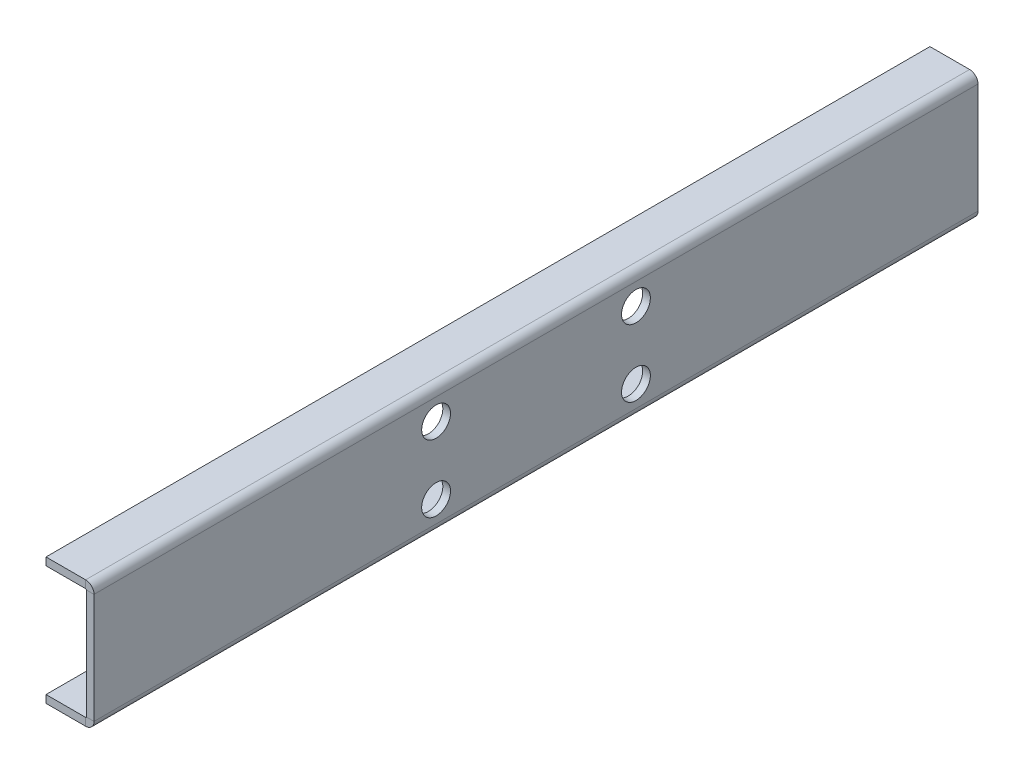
ISO-10303-21;
HEADER;
FILE_DESCRIPTION(('STEP AP214'),'2;1');
FILE_NAME('part.step','',(''),(''),'','','');
FILE_SCHEMA(('AUTOMOTIVE_DESIGN { 1 0 10303 214 1 1 1 1 }'));
ENDSEC;
DATA;
#1=APPLICATION_CONTEXT('core data for automotive mechanical design processes');
#2=APPLICATION_PROTOCOL_DEFINITION('international standard','automotive_design',2000,#1);
#3=PRODUCT_CONTEXT('',#1,'mechanical');
#4=PRODUCT('Part','Part','',(#3));
#5=PRODUCT_RELATED_PRODUCT_CATEGORY('part','',(#4));
#6=PRODUCT_DEFINITION_FORMATION('','',#4);
#7=PRODUCT_DEFINITION_CONTEXT('part definition',#1,'design');
#8=PRODUCT_DEFINITION('design','',#6,#7);
#9=PRODUCT_DEFINITION_SHAPE('','',#8);
#10=(LENGTH_UNIT() NAMED_UNIT(*) SI_UNIT(.MILLI.,.METRE.));
#11=(NAMED_UNIT(*) PLANE_ANGLE_UNIT() SI_UNIT($,.RADIAN.));
#12=(NAMED_UNIT(*) SI_UNIT($,.STERADIAN.) SOLID_ANGLE_UNIT());
#13=UNCERTAINTY_MEASURE_WITH_UNIT(LENGTH_MEASURE(1.E-05),#10,'distance_accuracy_value','');
#14=(GEOMETRIC_REPRESENTATION_CONTEXT(3) GLOBAL_UNCERTAINTY_ASSIGNED_CONTEXT((#13)) GLOBAL_UNIT_ASSIGNED_CONTEXT((#10,
#11,#12)) REPRESENTATION_CONTEXT('',''));
#15=CARTESIAN_POINT('',(0.,0.,0.));
#16=DIRECTION('',(0.,0.,1.));
#17=DIRECTION('',(1.,0.,0.));
#18=AXIS2_PLACEMENT_3D('',#15,#16,#17);
#19=CARTESIAN_POINT('',(-0.736600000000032,0.,460.));
#20=DIRECTION('',(0.,0.,1.));
#21=DIRECTION('',(1.,0.,0.));
#22=AXIS2_PLACEMENT_3D('',#19,#20,#21);
#23=PLANE('',#22);
#24=DIRECTION('',(0.,1.,0.));
#25=VECTOR('',#24,1.);
#26=CARTESIAN_POINT('',(-0.736600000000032,0.,460.));
#27=LINE('',#26,#25);
#28=CARTESIAN_POINT('',(-0.736600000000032,0.,460.));
#29=VERTEX_POINT('',#28);
#30=CARTESIAN_POINT('',(-0.736600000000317,8.,460.));
#31=VERTEX_POINT('',#30);
#32=EDGE_CURVE('E11',#29,#31,#27,.T.);
#33=ORIENTED_EDGE('',*,*,#32,.F.);
#34=CARTESIAN_POINT('',(-0.736600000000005,-0.7366,460.));
#35=DIRECTION('',(0.,0.,1.));
#36=DIRECTION('',(1.,0.,0.));
#37=AXIS2_PLACEMENT_3D('',#34,#35,#36);
#38=CIRCLE('',#37,0.7366);
#39=CARTESIAN_POINT('',(0.,-0.736599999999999,460.));
#40=VERTEX_POINT('',#39);
#41=EDGE_CURVE('E213',#29,#40,#38,.F.);
#42=ORIENTED_EDGE('',*,*,#41,.T.);
#43=DIRECTION('',(-1.,0.,0.));
#44=VECTOR('',#43,1.);
#45=CARTESIAN_POINT('',(8.,-0.736599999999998,460.));
#46=LINE('',#45,#44);
#47=CARTESIAN_POINT('',(8.,-0.736599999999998,460.));
#48=VERTEX_POINT('',#47);
#49=EDGE_CURVE('E51',#48,#40,#46,.T.);
#50=ORIENTED_EDGE('',*,*,#49,.F.);
#51=CARTESIAN_POINT('',(-0.736600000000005,-0.7366,460.));
#52=DIRECTION('',(0.,0.,1.));
#53=DIRECTION('',(1.,0.,0.));
#54=AXIS2_PLACEMENT_3D('',#51,#52,#53);
#55=CIRCLE('',#54,8.7366);
#56=EDGE_CURVE('E201',#31,#48,#55,.F.);
#57=ORIENTED_EDGE('',*,*,#56,.F.);
#58=EDGE_LOOP('',(#33,#42,#50,#57));
#59=FACE_BOUND('',#58,.T.);
#60=ADVANCED_FACE('F43',(#59),#23,.T.);
#61=CARTESIAN_POINT('',(8.,-0.736599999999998,460.));
#62=DIRECTION('',(0.,0.,1.));
#63=DIRECTION('',(1.,0.,0.));
#64=AXIS2_PLACEMENT_3D('',#61,#62,#63);
#65=PLANE('',#64);
#66=DIRECTION('',(1.,0.,0.));
#67=VECTOR('',#66,1.);
#68=CARTESIAN_POINT('',(-42.,0.,460.));
#69=LINE('',#68,#67);
#70=CARTESIAN_POINT('',(-42.,0.,460.));
#71=VERTEX_POINT('',#70);
#72=EDGE_CURVE('E210',#71,#29,#69,.T.);
#73=ORIENTED_EDGE('',*,*,#72,.T.);
#74=ORIENTED_EDGE('',*,*,#32,.T.);
#75=DIRECTION('',(1.,0.,0.));
#76=VECTOR('',#75,1.);
#77=CARTESIAN_POINT('',(-42.,8.,460.));
#78=LINE('',#77,#76);
#79=CARTESIAN_POINT('',(-42.,8.,460.));
#80=VERTEX_POINT('',#79);
#81=EDGE_CURVE('E204',#80,#31,#78,.T.);
#82=ORIENTED_EDGE('',*,*,#81,.F.);
#83=DIRECTION('',(0.,1.,0.));
#84=VECTOR('',#83,1.);
#85=CARTESIAN_POINT('',(-42.,0.,460.));
#86=LINE('',#85,#84);
#87=EDGE_CURVE('E207',#71,#80,#86,.T.);
#88=ORIENTED_EDGE('',*,*,#87,.F.);
#89=EDGE_LOOP('',(#73,#74,#82,#88));
#90=FACE_BOUND('',#89,.T.);
#91=ADVANCED_FACE('F313',(#90),#65,.T.);
#92=CARTESIAN_POINT('',(0.,-0.736599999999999,-460.));
#93=DIRECTION('',(0.,0.,-1.));
#94=DIRECTION('',(-1.,0.,0.));
#95=AXIS2_PLACEMENT_3D('',#92,#93,#94);
#96=PLANE('',#95);
#97=DIRECTION('',(1.,0.,0.));
#98=VECTOR('',#97,1.);
#99=CARTESIAN_POINT('',(0.,-0.736599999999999,-460.));
#100=LINE('',#99,#98);
#101=CARTESIAN_POINT('',(0.,-0.736599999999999,-460.));
#102=VERTEX_POINT('',#101);
#103=CARTESIAN_POINT('',(8.,-0.736599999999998,-460.));
#104=VERTEX_POINT('',#103);
#105=EDGE_CURVE('E254',#102,#104,#100,.T.);
#106=ORIENTED_EDGE('',*,*,#105,.F.);
#107=CARTESIAN_POINT('',(-0.736600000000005,-0.7366,-460.));
#108=DIRECTION('',(0.,0.,1.));
#109=DIRECTION('',(1.,0.,0.));
#110=AXIS2_PLACEMENT_3D('',#107,#108,#109);
#111=CIRCLE('',#110,0.7366);
#112=CARTESIAN_POINT('',(-0.736600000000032,0.,-460.));
#113=VERTEX_POINT('',#112);
#114=EDGE_CURVE('E180',#113,#102,#111,.F.);
#115=ORIENTED_EDGE('',*,*,#114,.F.);
#116=DIRECTION('',(0.,-1.,0.));
#117=VECTOR('',#116,1.);
#118=CARTESIAN_POINT('',(-0.736600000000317,8.,-460.));
#119=LINE('',#118,#117);
#120=CARTESIAN_POINT('',(-0.736600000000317,8.,-460.));
#121=VERTEX_POINT('',#120);
#122=EDGE_CURVE('E252',#121,#113,#119,.T.);
#123=ORIENTED_EDGE('',*,*,#122,.F.);
#124=CARTESIAN_POINT('',(-0.736600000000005,-0.7366,-460.));
#125=DIRECTION('',(0.,0.,1.));
#126=DIRECTION('',(1.,0.,0.));
#127=AXIS2_PLACEMENT_3D('',#124,#125,#126);
#128=CIRCLE('',#127,8.7366);
#129=EDGE_CURVE('E168',#121,#104,#128,.F.);
#130=ORIENTED_EDGE('',*,*,#129,.T.);
#131=EDGE_LOOP('',(#106,#115,#123,#130));
#132=FACE_BOUND('',#131,.T.);
#133=ADVANCED_FACE('F298',(#132),#96,.T.);
#134=CARTESIAN_POINT('',(-0.736600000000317,8.,-460.));
#135=DIRECTION('',(0.,0.,-1.));
#136=DIRECTION('',(-1.,0.,0.));
#137=AXIS2_PLACEMENT_3D('',#134,#135,#136);
#138=PLANE('',#137);
#139=DIRECTION('',(0.,-1.,0.));
#140=VECTOR('',#139,1.);
#141=CARTESIAN_POINT('',(0.,0.,-460.));
#142=LINE('',#141,#140);
#143=CARTESIAN_POINT('',(0.,-115.2634,-460.));
#144=VERTEX_POINT('',#143);
#145=EDGE_CURVE('E183',#102,#144,#142,.T.);
#146=ORIENTED_EDGE('',*,*,#145,.F.);
#147=ORIENTED_EDGE('',*,*,#105,.T.);
#148=DIRECTION('',(0.,-1.,0.));
#149=VECTOR('',#148,1.);
#150=CARTESIAN_POINT('',(8.,0.,-460.));
#151=LINE('',#150,#149);
#152=CARTESIAN_POINT('',(8.00000000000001,-115.263399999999,-460.));
#153=VERTEX_POINT('',#152);
#154=EDGE_CURVE('E165',#104,#153,#151,.T.);
#155=ORIENTED_EDGE('',*,*,#154,.T.);
#156=DIRECTION('',(-1.,0.,0.));
#157=VECTOR('',#156,1.);
#158=CARTESIAN_POINT('',(8.00000000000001,-115.263399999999,-460.));
#159=LINE('',#158,#157);
#160=EDGE_CURVE('E143',#153,#144,#159,.T.);
#161=ORIENTED_EDGE('',*,*,#160,.T.);
#162=EDGE_LOOP('',(#146,#147,#155,#161));
#163=FACE_BOUND('',#162,.T.);
#164=ADVANCED_FACE('F354',(#163),#138,.T.);
#165=CARTESIAN_POINT('',(0.,-115.2634,460.));
#166=DIRECTION('',(0.,0.,1.));
#167=DIRECTION('',(1.,0.,0.));
#168=AXIS2_PLACEMENT_3D('',#165,#166,#167);
#169=PLANE('',#168);
#170=DIRECTION('',(1.,0.,0.));
#171=VECTOR('',#170,1.);
#172=CARTESIAN_POINT('',(0.,-115.2634,460.));
#173=LINE('',#172,#171);
#174=CARTESIAN_POINT('',(0.,-115.2634,460.));
#175=VERTEX_POINT('',#174);
#176=CARTESIAN_POINT('',(8.00000000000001,-115.263399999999,460.));
#177=VERTEX_POINT('',#176);
#178=EDGE_CURVE('E66',#175,#177,#173,.T.);
#179=ORIENTED_EDGE('',*,*,#178,.F.);
#180=CARTESIAN_POINT('',(-0.736599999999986,-115.2634,460.));
#181=DIRECTION('',(0.,0.,1.));
#182=DIRECTION('',(1.,0.,0.));
#183=AXIS2_PLACEMENT_3D('',#180,#181,#182);
#184=CIRCLE('',#183,0.7366);
#185=CARTESIAN_POINT('',(-0.736599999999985,-116.,460.));
#186=VERTEX_POINT('',#185);
#187=EDGE_CURVE('E218',#175,#186,#184,.F.);
#188=ORIENTED_EDGE('',*,*,#187,.T.);
#189=DIRECTION('',(0.,1.,0.));
#190=VECTOR('',#189,1.);
#191=CARTESIAN_POINT('',(-0.736599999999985,-124.,460.));
#192=LINE('',#191,#190);
#193=CARTESIAN_POINT('',(-0.736599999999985,-124.,460.));
#194=VERTEX_POINT('',#193);
#195=EDGE_CURVE('E59',#194,#186,#192,.T.);
#196=ORIENTED_EDGE('',*,*,#195,.F.);
#197=CARTESIAN_POINT('',(-0.736599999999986,-115.2634,460.));
#198=DIRECTION('',(0.,0.,1.));
#199=DIRECTION('',(1.,0.,0.));
#200=AXIS2_PLACEMENT_3D('',#197,#198,#199);
#201=CIRCLE('',#200,8.7366);
#202=EDGE_CURVE('E195',#177,#194,#201,.F.);
#203=ORIENTED_EDGE('',*,*,#202,.F.);
#204=EDGE_LOOP('',(#179,#188,#196,#203));
#205=FACE_BOUND('',#204,.T.);
#206=ADVANCED_FACE('F330',(#205),#169,.T.);
#207=CARTESIAN_POINT('',(-0.736599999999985,-124.,460.));
#208=DIRECTION('',(0.,0.,1.));
#209=DIRECTION('',(1.,0.,0.));
#210=AXIS2_PLACEMENT_3D('',#207,#208,#209);
#211=PLANE('',#210);
#212=DIRECTION('',(0.,-1.,0.));
#213=VECTOR('',#212,1.);
#214=CARTESIAN_POINT('',(0.,0.,460.));
#215=LINE('',#214,#213);
#216=EDGE_CURVE('E216',#40,#175,#215,.T.);
#217=ORIENTED_EDGE('',*,*,#216,.T.);
#218=ORIENTED_EDGE('',*,*,#178,.T.);
#219=DIRECTION('',(0.,-1.,0.));
#220=VECTOR('',#219,1.);
#221=CARTESIAN_POINT('',(8.,0.,460.));
#222=LINE('',#221,#220);
#223=EDGE_CURVE('E198',#48,#177,#222,.T.);
#224=ORIENTED_EDGE('',*,*,#223,.F.);
#225=ORIENTED_EDGE('',*,*,#49,.T.);
#226=EDGE_LOOP('',(#217,#218,#224,#225));
#227=FACE_BOUND('',#226,.T.);
#228=ADVANCED_FACE('F327',(#227),#211,.T.);
#229=CARTESIAN_POINT('',(-0.736599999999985,-116.,-460.));
#230=DIRECTION('',(0.,0.,-1.));
#231=DIRECTION('',(-1.,0.,0.));
#232=AXIS2_PLACEMENT_3D('',#229,#230,#231);
#233=PLANE('',#232);
#234=DIRECTION('',(0.,-1.,0.));
#235=VECTOR('',#234,1.);
#236=CARTESIAN_POINT('',(-0.736599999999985,-116.,-460.));
#237=LINE('',#236,#235);
#238=CARTESIAN_POINT('',(-0.736599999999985,-116.,-460.));
#239=VERTEX_POINT('',#238);
#240=CARTESIAN_POINT('',(-0.736599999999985,-124.,-460.));
#241=VERTEX_POINT('',#240);
#242=EDGE_CURVE('E248',#239,#241,#237,.T.);
#243=ORIENTED_EDGE('',*,*,#242,.F.);
#244=CARTESIAN_POINT('',(-0.736599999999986,-115.2634,-460.));
#245=DIRECTION('',(0.,0.,1.));
#246=DIRECTION('',(1.,0.,0.));
#247=AXIS2_PLACEMENT_3D('',#244,#245,#246);
#248=CIRCLE('',#247,0.7366);
#249=EDGE_CURVE('E186',#144,#239,#248,.F.);
#250=ORIENTED_EDGE('',*,*,#249,.F.);
#251=ORIENTED_EDGE('',*,*,#160,.F.);
#252=CARTESIAN_POINT('',(-0.736599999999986,-115.2634,-460.));
#253=DIRECTION('',(0.,0.,1.));
#254=DIRECTION('',(1.,0.,0.));
#255=AXIS2_PLACEMENT_3D('',#252,#253,#254);
#256=CIRCLE('',#255,8.7366);
#257=EDGE_CURVE('E159',#153,#241,#256,.F.);
#258=ORIENTED_EDGE('',*,*,#257,.T.);
#259=EDGE_LOOP('',(#243,#250,#251,#258));
#260=FACE_BOUND('',#259,.T.);
#261=ADVANCED_FACE('F363',(#260),#233,.T.);
#262=CARTESIAN_POINT('',(8.00000000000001,-115.263399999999,-460.));
#263=DIRECTION('',(0.,0.,-1.));
#264=DIRECTION('',(-1.,0.,0.));
#265=AXIS2_PLACEMENT_3D('',#262,#263,#264);
#266=PLANE('',#265);
#267=DIRECTION('',(-1.,0.,0.));
#268=VECTOR('',#267,1.);
#269=CARTESIAN_POINT('',(0.,-116.,-460.));
#270=LINE('',#269,#268);
#271=CARTESIAN_POINT('',(-42.,-116.,-460.));
#272=VERTEX_POINT('',#271);
#273=EDGE_CURVE('E148',#239,#272,#270,.T.);
#274=ORIENTED_EDGE('',*,*,#273,.F.);
#275=ORIENTED_EDGE('',*,*,#242,.T.);
#276=DIRECTION('',(1.,0.,0.));
#277=VECTOR('',#276,1.);
#278=CARTESIAN_POINT('',(0.,-124.,-460.));
#279=LINE('',#278,#277);
#280=CARTESIAN_POINT('',(-42.,-124.,-460.));
#281=VERTEX_POINT('',#280);
#282=EDGE_CURVE('E157',#241,#281,#279,.F.);
#283=ORIENTED_EDGE('',*,*,#282,.T.);
#284=DIRECTION('',(0.,1.,0.));
#285=VECTOR('',#284,1.);
#286=CARTESIAN_POINT('',(-42.,-124.,-460.));
#287=LINE('',#286,#285);
#288=EDGE_CURVE('E137',#281,#272,#287,.T.);
#289=ORIENTED_EDGE('',*,*,#288,.T.);
#290=EDGE_LOOP('',(#274,#275,#283,#289));
#291=FACE_BOUND('',#290,.T.);
#292=ADVANCED_FACE('F155',(#291),#266,.T.);
#293=CARTESIAN_POINT('',(0.,-116.,460.));
#294=DIRECTION('',(0.,-1.,0.));
#295=DIRECTION('',(0.,0.,-1.));
#296=AXIS2_PLACEMENT_3D('',#293,#294,#295);
#297=PLANE('',#296);
#298=ORIENTED_EDGE('',*,*,#273,.T.);
#299=DIRECTION('',(0.,0.,-1.));
#300=VECTOR('',#299,1.);
#301=CARTESIAN_POINT('',(-42.,-116.,460.));
#302=LINE('',#301,#300);
#303=CARTESIAN_POINT('',(-42.,-116.,460.));
#304=VERTEX_POINT('',#303);
#305=EDGE_CURVE('E133',#304,#272,#302,.T.);
#306=ORIENTED_EDGE('',*,*,#305,.F.);
#307=DIRECTION('',(-1.,0.,0.));
#308=VECTOR('',#307,1.);
#309=CARTESIAN_POINT('',(0.,-116.,460.));
#310=LINE('',#309,#308);
#311=EDGE_CURVE('E189',#186,#304,#310,.T.);
#312=ORIENTED_EDGE('',*,*,#311,.F.);
#313=DIRECTION('',(0.,0.,-1.));
#314=VECTOR('',#313,1.);
#315=CARTESIAN_POINT('',(-0.736599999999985,-116.,460.));
#316=LINE('',#315,#314);
#317=EDGE_CURVE('E151',#186,#239,#316,.T.);
#318=ORIENTED_EDGE('',*,*,#317,.T.);
#319=EDGE_LOOP('',(#298,#306,#312,#318));
#320=FACE_BOUND('',#319,.T.);
#321=ADVANCED_FACE('F149',(#320),#297,.F.);
#322=CARTESIAN_POINT('',(-42.,-124.,460.));
#323=DIRECTION('',(-1.,0.,0.));
#324=DIRECTION('',(0.,0.,1.));
#325=AXIS2_PLACEMENT_3D('',#322,#323,#324);
#326=PLANE('',#325);
#327=ORIENTED_EDGE('',*,*,#288,.F.);
#328=DIRECTION('',(0.,0.,-1.));
#329=VECTOR('',#328,1.);
#330=CARTESIAN_POINT('',(-42.,-124.,460.));
#331=LINE('',#330,#329);
#332=CARTESIAN_POINT('',(-42.,-124.,460.));
#333=VERTEX_POINT('',#332);
#334=EDGE_CURVE('E144',#333,#281,#331,.T.);
#335=ORIENTED_EDGE('',*,*,#334,.F.);
#336=DIRECTION('',(0.,1.,0.));
#337=VECTOR('',#336,1.);
#338=CARTESIAN_POINT('',(-42.,-124.,460.));
#339=LINE('',#338,#337);
#340=EDGE_CURVE('E140',#333,#304,#339,.T.);
#341=ORIENTED_EDGE('',*,*,#340,.T.);
#342=ORIENTED_EDGE('',*,*,#305,.T.);
#343=EDGE_LOOP('',(#327,#335,#341,#342));
#344=FACE_BOUND('',#343,.T.);
#345=ADVANCED_FACE('F135',(#344),#326,.T.);
#346=CARTESIAN_POINT('',(0.,-124.,460.));
#347=DIRECTION('',(0.,-1.,0.));
#348=DIRECTION('',(0.,0.,-1.));
#349=AXIS2_PLACEMENT_3D('',#346,#347,#348);
#350=PLANE('',#349);
#351=ORIENTED_EDGE('',*,*,#282,.F.);
#352=DIRECTION('',(0.,0.,-1.));
#353=VECTOR('',#352,1.);
#354=CARTESIAN_POINT('',(-0.736599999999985,-124.,460.));
#355=LINE('',#354,#353);
#356=EDGE_CURVE('E243',#194,#241,#355,.T.);
#357=ORIENTED_EDGE('',*,*,#356,.F.);
#358=DIRECTION('',(1.,0.,0.));
#359=VECTOR('',#358,1.);
#360=CARTESIAN_POINT('',(0.,-124.,460.));
#361=LINE('',#360,#359);
#362=EDGE_CURVE('E192',#194,#333,#361,.F.);
#363=ORIENTED_EDGE('',*,*,#362,.T.);
#364=ORIENTED_EDGE('',*,*,#334,.T.);
#365=EDGE_LOOP('',(#351,#357,#363,#364));
#366=FACE_BOUND('',#365,.T.);
#367=ADVANCED_FACE('F334',(#366),#350,.T.);
#368=CARTESIAN_POINT('',(-0.736599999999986,-115.2634,460.));
#369=DIRECTION('',(0.,0.,-1.));
#370=DIRECTION('',(-1.,0.,0.));
#371=AXIS2_PLACEMENT_3D('',#368,#369,#370);
#372=CYLINDRICAL_SURFACE('',#371,8.7366);
#373=ORIENTED_EDGE('',*,*,#257,.F.);
#374=DIRECTION('',(0.,0.,-1.));
#375=VECTOR('',#374,1.);
#376=CARTESIAN_POINT('',(8.00000000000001,-115.263399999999,460.));
#377=LINE('',#376,#375);
#378=EDGE_CURVE('E240',#177,#153,#377,.T.);
#379=ORIENTED_EDGE('',*,*,#378,.F.);
#380=ORIENTED_EDGE('',*,*,#202,.T.);
#381=ORIENTED_EDGE('',*,*,#356,.T.);
#382=EDGE_LOOP('',(#373,#379,#380,#381));
#383=FACE_BOUND('',#382,.T.);
#384=ADVANCED_FACE('F287',(#383),#372,.T.);
#385=CARTESIAN_POINT('',(8.,0.,460.));
#386=DIRECTION('',(1.,0.,0.));
#387=DIRECTION('',(0.,1.,0.));
#388=AXIS2_PLACEMENT_3D('',#385,#386,#387);
#389=PLANE('',#388);
#390=CARTESIAN_POINT('',(8.,-23.,-104.));
#391=DIRECTION('',(1.,0.,0.));
#392=DIRECTION('',(0.,1.,0.));
#393=AXIS2_PLACEMENT_3D('',#390,#391,#392);
#394=CIRCLE('',#393,15.);
#395=CARTESIAN_POINT('',(8.,-7.99999999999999,-104.));
#396=VERTEX_POINT('',#395);
#397=EDGE_CURVE('E275',#396,#396,#394,.T.);
#398=ORIENTED_EDGE('',*,*,#397,.F.);
#399=EDGE_LOOP('',(#398));
#400=FACE_BOUND('',#399,.T.);
#401=CARTESIAN_POINT('',(8.00000000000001,-93.,-104.));
#402=DIRECTION('',(1.,0.,0.));
#403=DIRECTION('',(0.,1.,0.));
#404=AXIS2_PLACEMENT_3D('',#401,#402,#403);
#405=CIRCLE('',#404,15.);
#406=CARTESIAN_POINT('',(8.00000000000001,-78.,-104.));
#407=VERTEX_POINT('',#406);
#408=EDGE_CURVE('E265',#407,#407,#405,.T.);
#409=ORIENTED_EDGE('',*,*,#408,.F.);
#410=EDGE_LOOP('',(#409));
#411=FACE_BOUND('',#410,.T.);
#412=CARTESIAN_POINT('',(8.,-23.,104.));
#413=DIRECTION('',(1.,0.,0.));
#414=DIRECTION('',(0.,1.,0.));
#415=AXIS2_PLACEMENT_3D('',#412,#413,#414);
#416=CIRCLE('',#415,15.);
#417=CARTESIAN_POINT('',(8.,-7.99999999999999,104.));
#418=VERTEX_POINT('',#417);
#419=EDGE_CURVE('E262',#418,#418,#416,.T.);
#420=ORIENTED_EDGE('',*,*,#419,.F.);
#421=EDGE_LOOP('',(#420));
#422=FACE_BOUND('',#421,.T.);
#423=CARTESIAN_POINT('',(8.00000000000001,-93.,104.));
#424=DIRECTION('',(1.,0.,0.));
#425=DIRECTION('',(0.,1.,0.));
#426=AXIS2_PLACEMENT_3D('',#423,#424,#425);
#427=CIRCLE('',#426,15.);
#428=CARTESIAN_POINT('',(8.00000000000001,-78.,104.));
#429=VERTEX_POINT('',#428);
#430=EDGE_CURVE('E259',#429,#429,#427,.T.);
#431=ORIENTED_EDGE('',*,*,#430,.F.);
#432=EDGE_LOOP('',(#431));
#433=FACE_BOUND('',#432,.T.);
#434=ORIENTED_EDGE('',*,*,#154,.F.);
#435=DIRECTION('',(0.,0.,-1.));
#436=VECTOR('',#435,1.);
#437=CARTESIAN_POINT('',(8.,-0.736599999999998,460.));
#438=LINE('',#437,#436);
#439=EDGE_CURVE('E237',#48,#104,#438,.T.);
#440=ORIENTED_EDGE('',*,*,#439,.F.);
#441=ORIENTED_EDGE('',*,*,#223,.T.);
#442=ORIENTED_EDGE('',*,*,#378,.T.);
#443=EDGE_LOOP('',(#434,#440,#441,#442));
#444=FACE_BOUND('',#443,.T.);
#445=ADVANCED_FACE('F283',(#400,#411,#422,#433,#444),#389,.T.);
#446=CARTESIAN_POINT('',(-0.736600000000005,-0.7366,460.));
#447=DIRECTION('',(0.,0.,-1.));
#448=DIRECTION('',(-1.,0.,0.));
#449=AXIS2_PLACEMENT_3D('',#446,#447,#448);
#450=CYLINDRICAL_SURFACE('',#449,8.7366);
#451=ORIENTED_EDGE('',*,*,#129,.F.);
#452=DIRECTION('',(0.,0.,-1.));
#453=VECTOR('',#452,1.);
#454=CARTESIAN_POINT('',(-0.736600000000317,8.,460.));
#455=LINE('',#454,#453);
#456=EDGE_CURVE('E234',#31,#121,#455,.T.);
#457=ORIENTED_EDGE('',*,*,#456,.F.);
#458=ORIENTED_EDGE('',*,*,#56,.T.);
#459=ORIENTED_EDGE('',*,*,#439,.T.);
#460=EDGE_LOOP('',(#451,#457,#458,#459));
#461=FACE_BOUND('',#460,.T.);
#462=ADVANCED_FACE('F286',(#461),#450,.T.);
#463=CARTESIAN_POINT('',(-42.,8.,460.));
#464=DIRECTION('',(0.,1.,0.));
#465=DIRECTION('',(0.,0.,1.));
#466=AXIS2_PLACEMENT_3D('',#463,#464,#465);
#467=PLANE('',#466);
#468=DIRECTION('',(1.,0.,0.));
#469=VECTOR('',#468,1.);
#470=CARTESIAN_POINT('',(-42.,8.,-460.));
#471=LINE('',#470,#469);
#472=CARTESIAN_POINT('',(-42.,8.,-460.));
#473=VERTEX_POINT('',#472);
#474=EDGE_CURVE('E171',#473,#121,#471,.T.);
#475=ORIENTED_EDGE('',*,*,#474,.F.);
#476=DIRECTION('',(0.,0.,-1.));
#477=VECTOR('',#476,1.);
#478=CARTESIAN_POINT('',(-42.,8.,460.));
#479=LINE('',#478,#477);
#480=EDGE_CURVE('E232',#80,#473,#479,.T.);
#481=ORIENTED_EDGE('',*,*,#480,.F.);
#482=ORIENTED_EDGE('',*,*,#81,.T.);
#483=ORIENTED_EDGE('',*,*,#456,.T.);
#484=EDGE_LOOP('',(#475,#481,#482,#483));
#485=FACE_BOUND('',#484,.T.);
#486=ADVANCED_FACE('F309',(#485),#467,.T.);
#487=CARTESIAN_POINT('',(-42.,0.,460.));
#488=DIRECTION('',(-1.,0.,0.));
#489=DIRECTION('',(0.,0.,1.));
#490=AXIS2_PLACEMENT_3D('',#487,#488,#489);
#491=PLANE('',#490);
#492=DIRECTION('',(0.,1.,0.));
#493=VECTOR('',#492,1.);
#494=CARTESIAN_POINT('',(-42.,0.,-460.));
#495=LINE('',#494,#493);
#496=CARTESIAN_POINT('',(-42.,0.,-460.));
#497=VERTEX_POINT('',#496);
#498=EDGE_CURVE('E174',#497,#473,#495,.T.);
#499=ORIENTED_EDGE('',*,*,#498,.F.);
#500=DIRECTION('',(0.,0.,-1.));
#501=VECTOR('',#500,1.);
#502=CARTESIAN_POINT('',(-42.,0.,460.));
#503=LINE('',#502,#501);
#504=EDGE_CURVE('E230',#71,#497,#503,.T.);
#505=ORIENTED_EDGE('',*,*,#504,.F.);
#506=ORIENTED_EDGE('',*,*,#87,.T.);
#507=ORIENTED_EDGE('',*,*,#480,.T.);
#508=EDGE_LOOP('',(#499,#505,#506,#507));
#509=FACE_BOUND('',#508,.T.);
#510=ADVANCED_FACE('F315',(#509),#491,.T.);
#511=CARTESIAN_POINT('',(-42.,0.,460.));
#512=DIRECTION('',(0.,1.,0.));
#513=DIRECTION('',(0.,0.,1.));
#514=AXIS2_PLACEMENT_3D('',#511,#512,#513);
#515=PLANE('',#514);
#516=DIRECTION('',(1.,0.,0.));
#517=VECTOR('',#516,1.);
#518=CARTESIAN_POINT('',(-42.,0.,-460.));
#519=LINE('',#518,#517);
#520=EDGE_CURVE('E177',#497,#113,#519,.T.);
#521=ORIENTED_EDGE('',*,*,#520,.T.);
#522=DIRECTION('',(0.,0.,-1.));
#523=VECTOR('',#522,1.);
#524=CARTESIAN_POINT('',(-0.736600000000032,0.,460.));
#525=LINE('',#524,#523);
#526=EDGE_CURVE('E227',#29,#113,#525,.T.);
#527=ORIENTED_EDGE('',*,*,#526,.F.);
#528=ORIENTED_EDGE('',*,*,#72,.F.);
#529=ORIENTED_EDGE('',*,*,#504,.T.);
#530=EDGE_LOOP('',(#521,#527,#528,#529));
#531=FACE_BOUND('',#530,.T.);
#532=ADVANCED_FACE('F319',(#531),#515,.F.);
#533=CARTESIAN_POINT('',(-0.736600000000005,-0.7366,460.));
#534=DIRECTION('',(0.,0.,-1.));
#535=DIRECTION('',(-1.,0.,0.));
#536=AXIS2_PLACEMENT_3D('',#533,#534,#535);
#537=CYLINDRICAL_SURFACE('',#536,0.7366);
#538=ORIENTED_EDGE('',*,*,#114,.T.);
#539=DIRECTION('',(0.,0.,-1.));
#540=VECTOR('',#539,1.);
#541=CARTESIAN_POINT('',(0.,-0.736599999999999,460.));
#542=LINE('',#541,#540);
#543=EDGE_CURVE('E224',#40,#102,#542,.T.);
#544=ORIENTED_EDGE('',*,*,#543,.F.);
#545=ORIENTED_EDGE('',*,*,#41,.F.);
#546=ORIENTED_EDGE('',*,*,#526,.T.);
#547=EDGE_LOOP('',(#538,#544,#545,#546));
#548=FACE_BOUND('',#547,.T.);
#549=ADVANCED_FACE('F323',(#548),#537,.F.);
#550=CARTESIAN_POINT('',(0.,0.,460.));
#551=DIRECTION('',(1.,0.,0.));
#552=DIRECTION('',(0.,1.,0.));
#553=AXIS2_PLACEMENT_3D('',#550,#551,#552);
#554=PLANE('',#553);
#555=CARTESIAN_POINT('',(0.,-23.,-104.));
#556=DIRECTION('',(1.,0.,0.));
#557=DIRECTION('',(0.,1.,0.));
#558=AXIS2_PLACEMENT_3D('',#555,#556,#557);
#559=CIRCLE('',#558,15.);
#560=CARTESIAN_POINT('',(0.,-7.99999999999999,-104.));
#561=VERTEX_POINT('',#560);
#562=EDGE_CURVE('E46',#561,#561,#559,.T.);
#563=ORIENTED_EDGE('',*,*,#562,.T.);
#564=EDGE_LOOP('',(#563));
#565=FACE_BOUND('',#564,.T.);
#566=CARTESIAN_POINT('',(0.,-93.,-104.));
#567=DIRECTION('',(1.,0.,0.));
#568=DIRECTION('',(0.,1.,0.));
#569=AXIS2_PLACEMENT_3D('',#566,#567,#568);
#570=CIRCLE('',#569,15.);
#571=CARTESIAN_POINT('',(0.,-78.,-104.));
#572=VERTEX_POINT('',#571);
#573=EDGE_CURVE('E263',#572,#572,#570,.T.);
#574=ORIENTED_EDGE('',*,*,#573,.T.);
#575=EDGE_LOOP('',(#574));
#576=FACE_BOUND('',#575,.T.);
#577=CARTESIAN_POINT('',(0.,-23.,104.));
#578=DIRECTION('',(1.,0.,0.));
#579=DIRECTION('',(0.,1.,0.));
#580=AXIS2_PLACEMENT_3D('',#577,#578,#579);
#581=CIRCLE('',#580,15.);
#582=CARTESIAN_POINT('',(0.,-7.99999999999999,104.));
#583=VERTEX_POINT('',#582);
#584=EDGE_CURVE('E260',#583,#583,#581,.T.);
#585=ORIENTED_EDGE('',*,*,#584,.T.);
#586=EDGE_LOOP('',(#585));
#587=FACE_BOUND('',#586,.T.);
#588=CARTESIAN_POINT('',(0.,-93.,104.));
#589=DIRECTION('',(1.,0.,0.));
#590=DIRECTION('',(0.,1.,0.));
#591=AXIS2_PLACEMENT_3D('',#588,#589,#590);
#592=CIRCLE('',#591,15.);
#593=CARTESIAN_POINT('',(0.,-78.,104.));
#594=VERTEX_POINT('',#593);
#595=EDGE_CURVE('E153',#594,#594,#592,.T.);
#596=ORIENTED_EDGE('',*,*,#595,.T.);
#597=EDGE_LOOP('',(#596));
#598=FACE_BOUND('',#597,.T.);
#599=ORIENTED_EDGE('',*,*,#145,.T.);
#600=DIRECTION('',(0.,0.,-1.));
#601=VECTOR('',#600,1.);
#602=CARTESIAN_POINT('',(0.,-115.2634,460.));
#603=LINE('',#602,#601);
#604=EDGE_CURVE('E221',#175,#144,#603,.T.);
#605=ORIENTED_EDGE('',*,*,#604,.F.);
#606=ORIENTED_EDGE('',*,*,#216,.F.);
#607=ORIENTED_EDGE('',*,*,#543,.T.);
#608=EDGE_LOOP('',(#599,#605,#606,#607));
#609=FACE_BOUND('',#608,.T.);
#610=ADVANCED_FACE('F344',(#565,#576,#587,#598,#609),#554,.F.);
#611=CARTESIAN_POINT('',(-0.736599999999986,-115.2634,460.));
#612=DIRECTION('',(0.,0.,-1.));
#613=DIRECTION('',(-1.,0.,0.));
#614=AXIS2_PLACEMENT_3D('',#611,#612,#613);
#615=CYLINDRICAL_SURFACE('',#614,0.7366);
#616=ORIENTED_EDGE('',*,*,#249,.T.);
#617=ORIENTED_EDGE('',*,*,#317,.F.);
#618=ORIENTED_EDGE('',*,*,#187,.F.);
#619=ORIENTED_EDGE('',*,*,#604,.T.);
#620=EDGE_LOOP('',(#616,#617,#618,#619));
#621=FACE_BOUND('',#620,.T.);
#622=ADVANCED_FACE('F337',(#621),#615,.F.);
#623=CARTESIAN_POINT('',(-0.736599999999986,-115.2634,460.));
#624=DIRECTION('',(0.,0.,1.));
#625=DIRECTION('',(1.,0.,0.));
#626=AXIS2_PLACEMENT_3D('',#623,#624,#625);
#627=PLANE('',#626);
#628=ORIENTED_EDGE('',*,*,#311,.T.);
#629=ORIENTED_EDGE('',*,*,#340,.F.);
#630=ORIENTED_EDGE('',*,*,#362,.F.);
#631=ORIENTED_EDGE('',*,*,#195,.T.);
#632=EDGE_LOOP('',(#628,#629,#630,#631));
#633=FACE_BOUND('',#632,.T.);
#634=ADVANCED_FACE('F335',(#633),#627,.T.);
#635=CARTESIAN_POINT('',(-0.736599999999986,-115.2634,-460.));
#636=DIRECTION('',(0.,0.,1.));
#637=DIRECTION('',(1.,0.,0.));
#638=AXIS2_PLACEMENT_3D('',#635,#636,#637);
#639=PLANE('',#638);
#640=ORIENTED_EDGE('',*,*,#474,.T.);
#641=ORIENTED_EDGE('',*,*,#122,.T.);
#642=ORIENTED_EDGE('',*,*,#520,.F.);
#643=ORIENTED_EDGE('',*,*,#498,.T.);
#644=EDGE_LOOP('',(#640,#641,#642,#643));
#645=FACE_BOUND('',#644,.T.);
#646=ADVANCED_FACE('F305',(#645),#639,.F.);
#647=CARTESIAN_POINT('',(-1.99999999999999,-93.,104.));
#648=DIRECTION('',(1.,0.,0.));
#649=DIRECTION('',(0.,1.,0.));
#650=AXIS2_PLACEMENT_3D('',#647,#648,#649);
#651=CYLINDRICAL_SURFACE('',#650,15.);
#652=ORIENTED_EDGE('',*,*,#430,.T.);
#653=EDGE_LOOP('',(#652));
#654=FACE_BOUND('',#653,.T.);
#655=ORIENTED_EDGE('',*,*,#595,.F.);
#656=EDGE_LOOP('',(#655));
#657=FACE_BOUND('',#656,.T.);
#658=ADVANCED_FACE('F280',(#654,#657),#651,.F.);
#659=CARTESIAN_POINT('',(-2.,-23.,104.));
#660=DIRECTION('',(1.,0.,0.));
#661=DIRECTION('',(0.,1.,0.));
#662=AXIS2_PLACEMENT_3D('',#659,#660,#661);
#663=CYLINDRICAL_SURFACE('',#662,15.);
#664=ORIENTED_EDGE('',*,*,#419,.T.);
#665=EDGE_LOOP('',(#664));
#666=FACE_BOUND('',#665,.T.);
#667=ORIENTED_EDGE('',*,*,#584,.F.);
#668=EDGE_LOOP('',(#667));
#669=FACE_BOUND('',#668,.T.);
#670=ADVANCED_FACE('F400',(#666,#669),#663,.F.);
#671=CARTESIAN_POINT('',(-1.99999999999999,-93.,-104.));
#672=DIRECTION('',(1.,0.,0.));
#673=DIRECTION('',(0.,1.,0.));
#674=AXIS2_PLACEMENT_3D('',#671,#672,#673);
#675=CYLINDRICAL_SURFACE('',#674,15.);
#676=ORIENTED_EDGE('',*,*,#408,.T.);
#677=EDGE_LOOP('',(#676));
#678=FACE_BOUND('',#677,.T.);
#679=ORIENTED_EDGE('',*,*,#573,.F.);
#680=EDGE_LOOP('',(#679));
#681=FACE_BOUND('',#680,.T.);
#682=ADVANCED_FACE('F405',(#678,#681),#675,.F.);
#683=CARTESIAN_POINT('',(-2.,-23.,-104.));
#684=DIRECTION('',(1.,0.,0.));
#685=DIRECTION('',(0.,1.,0.));
#686=AXIS2_PLACEMENT_3D('',#683,#684,#685);
#687=CYLINDRICAL_SURFACE('',#686,15.);
#688=ORIENTED_EDGE('',*,*,#397,.T.);
#689=EDGE_LOOP('',(#688));
#690=FACE_BOUND('',#689,.T.);
#691=ORIENTED_EDGE('',*,*,#562,.F.);
#692=EDGE_LOOP('',(#691));
#693=FACE_BOUND('',#692,.T.);
#694=ADVANCED_FACE('F411',(#690,#693),#687,.F.);
#695=CLOSED_SHELL('',(#60,#91,#133,#164,#206,#228,#261,#292,#321,#345,#367,#384,#445,#462,#486,
#510,#532,#549,#610,#622,#634,#646,#658,#670,#682,#694));
#696=MANIFOLD_SOLID_BREP('B2',#695);
#697=ADVANCED_BREP_SHAPE_REPRESENTATION('',(#18,#696),#14);
#698=SHAPE_DEFINITION_REPRESENTATION(#9,#697);
ENDSEC;
END-ISO-10303-21;
